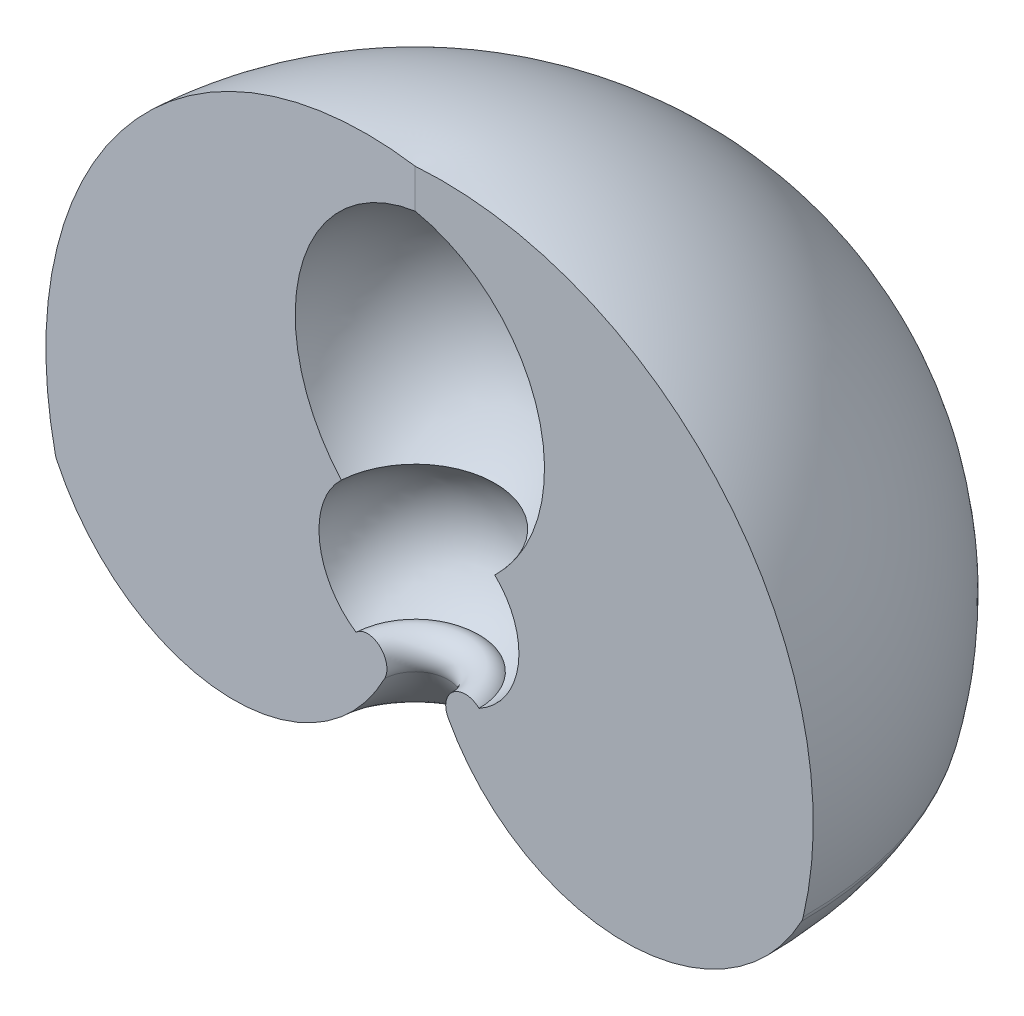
ISO-10303-21;
HEADER;
FILE_DESCRIPTION(('STEP AP214'),'2;1');
FILE_NAME('part.step','',(''),(''),'','','');
FILE_SCHEMA(('AUTOMOTIVE_DESIGN { 1 0 10303 214 1 1 1 1 }'));
ENDSEC;
DATA;
#1=APPLICATION_CONTEXT('core data for automotive mechanical design processes');
#2=APPLICATION_PROTOCOL_DEFINITION('international standard','automotive_design',2000,#1);
#3=PRODUCT_CONTEXT('',#1,'mechanical');
#4=PRODUCT('Part','Part','',(#3));
#5=PRODUCT_RELATED_PRODUCT_CATEGORY('part','',(#4));
#6=PRODUCT_DEFINITION_FORMATION('','',#4);
#7=PRODUCT_DEFINITION_CONTEXT('part definition',#1,'design');
#8=PRODUCT_DEFINITION('design','',#6,#7);
#9=PRODUCT_DEFINITION_SHAPE('','',#8);
#10=(LENGTH_UNIT() NAMED_UNIT(*) SI_UNIT(.MILLI.,.METRE.));
#11=(NAMED_UNIT(*) PLANE_ANGLE_UNIT() SI_UNIT($,.RADIAN.));
#12=(NAMED_UNIT(*) SI_UNIT($,.STERADIAN.) SOLID_ANGLE_UNIT());
#13=UNCERTAINTY_MEASURE_WITH_UNIT(LENGTH_MEASURE(1.E-05),#10,'distance_accuracy_value','');
#14=(GEOMETRIC_REPRESENTATION_CONTEXT(3) GLOBAL_UNCERTAINTY_ASSIGNED_CONTEXT((#13)) GLOBAL_UNIT_ASSIGNED_CONTEXT((#10,
#11,#12)) REPRESENTATION_CONTEXT('',''));
#15=CARTESIAN_POINT('',(0.,0.,0.));
#16=DIRECTION('',(0.,0.,1.));
#17=DIRECTION('',(1.,0.,0.));
#18=AXIS2_PLACEMENT_3D('',#15,#16,#17);
#19=CARTESIAN_POINT('',(0.,1121.95263140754,121.386345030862));
#20=DIRECTION('',(-1.,0.,0.));
#21=DIRECTION('',(0.,0.,-1.));
#22=AXIS2_PLACEMENT_3D('',#19,#20,#21);
#23=CIRCLE('',#22,602.80116582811);
#24=TRIMMED_CURVE('',#23,(PARAMETER_VALUE(-1.36803949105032)),
(PARAMETER_VALUE(1.36803949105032)),.T.,.PARAMETER.);
#25=CARTESIAN_POINT('',(0.,1121.95263140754,0.));
#26=DIRECTION('',(0.,-1.,0.));
#27=AXIS1_PLACEMENT('',#25,#26);
#28=SURFACE_OF_REVOLUTION('',#24,#27);
#29=CARTESIAN_POINT('',(0.,687.256603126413,0.));
#30=DIRECTION('',(0.,-1.,0.));
#31=DIRECTION('',(0.,0.,-1.));
#32=AXIS2_PLACEMENT_3D('',#29,#30,#31);
#33=CIRCLE('',#32,296.236222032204);
#34=CARTESIAN_POINT('',(-295.514605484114,687.256603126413,-20.6643942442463));
#35=VERTEX_POINT('',#34);
#36=CARTESIAN_POINT('',(296.236222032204,687.256603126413,0.));
#37=VERTEX_POINT('',#36);
#38=EDGE_CURVE('E11',#35,#37,#33,.T.);
#39=ORIENTED_EDGE('',*,*,#38,.T.);
#40=CARTESIAN_POINT('',(-121.386345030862,1121.95263140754,0.));
#41=DIRECTION('',(0.,0.,1.));
#42=DIRECTION('',(1.,0.,0.));
#43=AXIS2_PLACEMENT_3D('',#40,#41,#42);
#44=CIRCLE('',#43,602.80116582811);
#45=CARTESIAN_POINT('',(-1.64414563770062E-13,1712.40550909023,0.));
#46=VERTEX_POINT('',#45);
#47=EDGE_CURVE('E91',#46,#37,#44,.F.);
#48=ORIENTED_EDGE('',*,*,#47,.F.);
#49=CARTESIAN_POINT('',(121.090653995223,1121.95263140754,8.46748339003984));
#50=DIRECTION('',(0.0697564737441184,0.,-0.997564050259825));
#51=DIRECTION('',(-0.997564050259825,0.,-0.0697564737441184));
#52=AXIS2_PLACEMENT_3D('',#49,#50,#51);
#53=CIRCLE('',#52,602.80116582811);
#54=EDGE_CURVE('E93',#46,#35,#53,.F.);
#55=ORIENTED_EDGE('',*,*,#54,.T.);
#56=EDGE_LOOP('',(#39,#48,#55));
#57=FACE_BOUND('',#56,.T.);
#58=ADVANCED_FACE('F38',(#57),#28,.F.);
#59=CARTESIAN_POINT('',(0.,479.,0.));
#60=DIRECTION('',(0.,-1.,0.));
#61=DIRECTION('',(0.,0.,-1.));
#62=AXIS2_PLACEMENT_3D('',#59,#60,#61);
#63=DEGENERATE_TOROIDAL_SURFACE('',#62,100.,286.145885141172,.T.);
#64=CARTESIAN_POINT('',(0.,228.013432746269,0.));
#65=DIRECTION('',(0.,-1.,0.));
#66=DIRECTION('',(0.,0.,-1.));
#67=AXIS2_PLACEMENT_3D('',#64,#65,#66);
#68=CIRCLE('',#67,237.423471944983);
#69=CARTESIAN_POINT('',(-236.845120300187,228.013432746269,-16.5618241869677));
#70=VERTEX_POINT('',#69);
#71=CARTESIAN_POINT('',(237.423471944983,228.013432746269,0.));
#72=VERTEX_POINT('',#71);
#73=EDGE_CURVE('E45',#70,#72,#68,.T.);
#74=ORIENTED_EDGE('',*,*,#73,.T.);
#75=CARTESIAN_POINT('',(100.,479.,0.));
#76=DIRECTION('',(0.,0.,1.));
#77=DIRECTION('',(1.,0.,0.));
#78=AXIS2_PLACEMENT_3D('',#75,#76,#77);
#79=CIRCLE('',#78,286.145885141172);
#80=EDGE_CURVE('E101',#72,#37,#79,.T.);
#81=ORIENTED_EDGE('',*,*,#80,.T.);
#82=ORIENTED_EDGE('',*,*,#38,.F.);
#83=CARTESIAN_POINT('',(-99.7564050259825,479.,-6.97564737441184));
#84=DIRECTION('',(0.0697564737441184,0.,-0.997564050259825));
#85=DIRECTION('',(-0.997564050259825,0.,-0.0697564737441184));
#86=AXIS2_PLACEMENT_3D('',#83,#84,#85);
#87=CIRCLE('',#86,286.145885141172);
#88=EDGE_CURVE('E118',#70,#35,#87,.T.);
#89=ORIENTED_EDGE('',*,*,#88,.F.);
#90=EDGE_LOOP('',(#74,#81,#82,#89));
#91=FACE_BOUND('',#90,.T.);
#92=ADVANCED_FACE('F105',(#91),#63,.F.);
#93=CARTESIAN_POINT('',(0.,175.429693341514,0.));
#94=DIRECTION('',(0.,-1.,0.));
#95=DIRECTION('',(0.,0.,-1.));
#96=AXIS2_PLACEMENT_3D('',#93,#94,#95);
#97=TOROIDAL_SURFACE('',#96,186.643945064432,73.0999999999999);
#98=CARTESIAN_POINT('',(0.,141.111322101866,0.));
#99=DIRECTION('',(0.,-1.,0.));
#100=DIRECTION('',(0.,0.,-1.));
#101=AXIS2_PLACEMENT_3D('',#98,#99,#100);
#102=CIRCLE('',#101,122.100476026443);
#103=CARTESIAN_POINT('',(-121.803045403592,141.111322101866,-8.51729865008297));
#104=VERTEX_POINT('',#103);
#105=CARTESIAN_POINT('',(122.100476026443,141.111322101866,0.));
#106=VERTEX_POINT('',#105);
#107=EDGE_CURVE('E133',#104,#106,#102,.T.);
#108=ORIENTED_EDGE('',*,*,#107,.T.);
#109=CARTESIAN_POINT('',(186.643945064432,175.429693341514,0.));
#110=DIRECTION('',(0.,0.,1.));
#111=DIRECTION('',(1.,0.,0.));
#112=AXIS2_PLACEMENT_3D('',#109,#110,#111);
#113=CIRCLE('',#112,73.0999999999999);
#114=EDGE_CURVE('E106',#106,#72,#113,.F.);
#115=ORIENTED_EDGE('',*,*,#114,.T.);
#116=ORIENTED_EDGE('',*,*,#73,.F.);
#117=CARTESIAN_POINT('',(-186.189289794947,175.429693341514,-13.0196234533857));
#118=DIRECTION('',(0.0697564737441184,0.,-0.997564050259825));
#119=DIRECTION('',(-0.997564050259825,0.,-0.0697564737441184));
#120=AXIS2_PLACEMENT_3D('',#117,#118,#119);
#121=CIRCLE('',#120,73.0999999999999);
#122=EDGE_CURVE('E120',#104,#70,#121,.F.);
#123=ORIENTED_EDGE('',*,*,#122,.F.);
#124=EDGE_LOOP('',(#108,#115,#116,#123));
#125=FACE_BOUND('',#124,.T.);
#126=ADVANCED_FACE('F136',(#125),#97,.T.);
#127=CARTESIAN_POINT('',(0.,490.86763637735,0.));
#128=DIRECTION('',(0.,-1.,0.));
#129=DIRECTION('',(0.,0.,-1.));
#130=AXIS2_PLACEMENT_3D('',#127,#128,#129);
#131=TOROIDAL_SURFACE('',#130,779.896432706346,745.);
#132=CARTESIAN_POINT('',(0.,141.111322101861,0.));
#133=DIRECTION('',(0.,-1.,0.));
#134=DIRECTION('',(0.,0.,-1.));
#135=AXIS2_PLACEMENT_3D('',#132,#133,#134);
#136=CIRCLE('',#135,1437.69238938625);
#137=CARTESIAN_POINT('',(-1434.19024298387,141.111322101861,-100.288351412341));
#138=VERTEX_POINT('',#137);
#139=CARTESIAN_POINT('',(1437.69238938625,141.111322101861,0.));
#140=VERTEX_POINT('',#139);
#141=EDGE_CURVE('E131',#138,#140,#136,.T.);
#142=ORIENTED_EDGE('',*,*,#141,.T.);
#143=CARTESIAN_POINT('',(779.896432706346,490.86763637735,0.));
#144=DIRECTION('',(0.,0.,1.));
#145=DIRECTION('',(1.,0.,0.));
#146=AXIS2_PLACEMENT_3D('',#143,#144,#145);
#147=CIRCLE('',#146,745.);
#148=EDGE_CURVE('E108',#106,#140,#147,.T.);
#149=ORIENTED_EDGE('',*,*,#148,.F.);
#150=ORIENTED_EDGE('',*,*,#107,.F.);
#151=CARTESIAN_POINT('',(-777.996644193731,490.86763637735,-54.4028250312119));
#152=DIRECTION('',(0.0697564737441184,0.,-0.997564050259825));
#153=DIRECTION('',(-0.997564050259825,0.,-0.0697564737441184));
#154=AXIS2_PLACEMENT_3D('',#151,#152,#153);
#155=CIRCLE('',#154,745.);
#156=EDGE_CURVE('E123',#104,#138,#155,.T.);
#157=ORIENTED_EDGE('',*,*,#156,.T.);
#158=EDGE_LOOP('',(#142,#149,#150,#157));
#159=FACE_BOUND('',#158,.T.);
#160=ADVANCED_FACE('F141',(#159),#131,.T.);
#161=CARTESIAN_POINT('',(0.,175.42969334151,0.));
#162=DIRECTION('',(0.,-1.,0.));
#163=DIRECTION('',(0.,0.,-1.));
#164=AXIS2_PLACEMENT_3D('',#161,#162,#163);
#165=TOROIDAL_SURFACE('',#164,1373.14892034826,73.0999999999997);
#166=CARTESIAN_POINT('',(0.,158.474998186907,0.));
#167=DIRECTION('',(0.,-1.,0.));
#168=DIRECTION('',(0.,0.,-1.));
#169=AXIS2_PLACEMENT_3D('',#166,#167,#168);
#170=CIRCLE('',#169,1444.25551858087);
#171=CARTESIAN_POINT('',(-1440.73738472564,158.474998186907,-100.746172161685));
#172=VERTEX_POINT('',#171);
#173=CARTESIAN_POINT('',(1444.25551858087,158.474998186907,0.));
#174=VERTEX_POINT('',#173);
#175=EDGE_CURVE('E59',#172,#174,#170,.T.);
#176=ORIENTED_EDGE('',*,*,#175,.T.);
#177=CARTESIAN_POINT('',(1373.14892034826,175.42969334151,0.));
#178=DIRECTION('',(0.,0.,1.));
#179=DIRECTION('',(1.,0.,0.));
#180=AXIS2_PLACEMENT_3D('',#177,#178,#179);
#181=CIRCLE('',#180,73.0999999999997);
#182=EDGE_CURVE('E113',#140,#174,#181,.T.);
#183=ORIENTED_EDGE('',*,*,#182,.F.);
#184=ORIENTED_EDGE('',*,*,#141,.F.);
#185=CARTESIAN_POINT('',(-1369.80399859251,175.42969334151,-95.7860266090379));
#186=DIRECTION('',(0.0697564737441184,0.,-0.997564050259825));
#187=DIRECTION('',(-0.997564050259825,0.,-0.0697564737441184));
#188=AXIS2_PLACEMENT_3D('',#185,#186,#187);
#189=CIRCLE('',#188,73.0999999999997);
#190=EDGE_CURVE('E126',#138,#172,#189,.T.);
#191=ORIENTED_EDGE('',*,*,#190,.T.);
#192=EDGE_LOOP('',(#176,#183,#184,#191));
#193=FACE_BOUND('',#192,.T.);
#194=ADVANCED_FACE('F144',(#193),#165,.T.);
#195=CARTESIAN_POINT('',(0.,479.,-100.));
#196=DIRECTION('',(-1.,0.,0.));
#197=DIRECTION('',(0.,0.,-1.));
#198=AXIS2_PLACEMENT_3D('',#195,#196,#197);
#199=CIRCLE('',#198,1381.94036630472);
#200=TRIMMED_CURVE('',#199,(PARAMETER_VALUE(-1.64322164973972)),
(PARAMETER_VALUE(1.64322164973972)),.T.,.PARAMETER.);
#201=CARTESIAN_POINT('',(0.,479.,0.));
#202=DIRECTION('',(0.,-1.,0.));
#203=AXIS1_PLACEMENT('',#201,#202);
#204=SURFACE_OF_REVOLUTION('',#200,#203);
#205=CARTESIAN_POINT('',(-99.7564050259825,479.,-6.97564737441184));
#206=DIRECTION('',(0.0697564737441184,0.,-0.997564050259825));
#207=DIRECTION('',(-0.997564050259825,0.,-0.0697564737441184));
#208=AXIS2_PLACEMENT_3D('',#205,#206,#207);
#209=CIRCLE('',#208,1381.94036630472);
#210=CARTESIAN_POINT('',(0.,1857.31751640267,0.));
#211=VERTEX_POINT('',#210);
#212=EDGE_CURVE('E128',#172,#211,#209,.T.);
#213=ORIENTED_EDGE('',*,*,#212,.T.);
#214=CARTESIAN_POINT('',(100.,479.,0.));
#215=DIRECTION('',(0.,0.,1.));
#216=DIRECTION('',(1.,0.,0.));
#217=AXIS2_PLACEMENT_3D('',#214,#215,#216);
#218=CIRCLE('',#217,1381.94036630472);
#219=EDGE_CURVE('E52',#174,#211,#218,.T.);
#220=ORIENTED_EDGE('',*,*,#219,.F.);
#221=ORIENTED_EDGE('',*,*,#175,.F.);
#222=EDGE_LOOP('',(#213,#220,#221));
#223=FACE_BOUND('',#222,.T.);
#224=ADVANCED_FACE('F146',(#223),#204,.T.);
#225=CARTESIAN_POINT('',(0.,0.,0.));
#226=DIRECTION('',(0.0697564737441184,0.,-0.997564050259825));
#227=DIRECTION('',(-0.997564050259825,0.,-0.0697564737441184));
#228=AXIS2_PLACEMENT_3D('',#225,#226,#227);
#229=PLANE('',#228);
#230=DIRECTION('',(0.,-1.,0.));
#231=VECTOR('',#230,1.);
#232=CARTESIAN_POINT('',(0.,0.,0.));
#233=LINE('',#232,#231);
#234=EDGE_CURVE('E103',#211,#46,#233,.T.);
#235=ORIENTED_EDGE('',*,*,#234,.F.);
#236=ORIENTED_EDGE('',*,*,#212,.F.);
#237=ORIENTED_EDGE('',*,*,#190,.F.);
#238=ORIENTED_EDGE('',*,*,#156,.F.);
#239=ORIENTED_EDGE('',*,*,#122,.T.);
#240=ORIENTED_EDGE('',*,*,#88,.T.);
#241=ORIENTED_EDGE('',*,*,#54,.F.);
#242=EDGE_LOOP('',(#235,#236,#237,#238,#239,#240,#241));
#243=FACE_BOUND('',#242,.T.);
#244=ADVANCED_FACE('F148',(#243),#229,.F.);
#245=CARTESIAN_POINT('',(0.,0.,0.));
#246=DIRECTION('',(0.,0.,1.));
#247=DIRECTION('',(1.,0.,0.));
#248=AXIS2_PLACEMENT_3D('',#245,#246,#247);
#249=PLANE('',#248);
#250=ORIENTED_EDGE('',*,*,#234,.T.);
#251=ORIENTED_EDGE('',*,*,#47,.T.);
#252=ORIENTED_EDGE('',*,*,#80,.F.);
#253=ORIENTED_EDGE('',*,*,#114,.F.);
#254=ORIENTED_EDGE('',*,*,#148,.T.);
#255=ORIENTED_EDGE('',*,*,#182,.T.);
#256=ORIENTED_EDGE('',*,*,#219,.T.);
#257=EDGE_LOOP('',(#250,#251,#252,#253,#254,#255,#256));
#258=FACE_BOUND('',#257,.T.);
#259=ADVANCED_FACE('F99',(#258),#249,.T.);
#260=CLOSED_SHELL('',(#58,#92,#126,#160,#194,#224,#244,#259));
#261=MANIFOLD_SOLID_BREP('B2',#260);
#262=ADVANCED_BREP_SHAPE_REPRESENTATION('',(#18,#261),#14);
#263=SHAPE_DEFINITION_REPRESENTATION(#9,#262);
ENDSEC;
END-ISO-10303-21;
